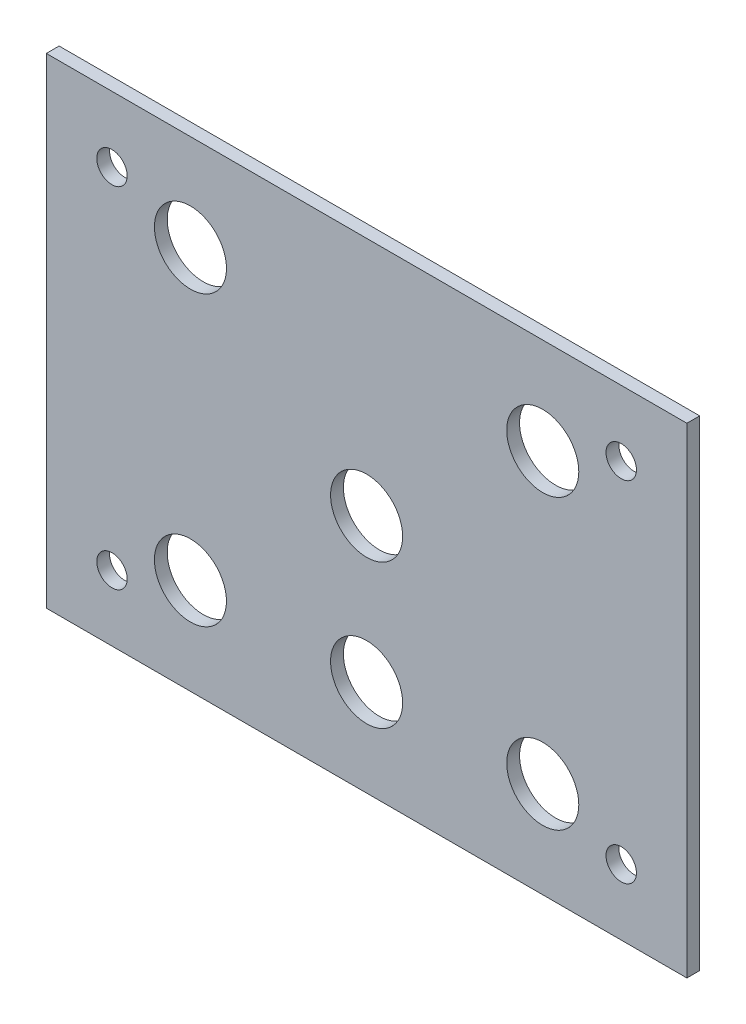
ISO-10303-21;
HEADER;
FILE_DESCRIPTION(('STEP AP214'),'2;1');
FILE_NAME('part.step','',(''),(''),'','','');
FILE_SCHEMA(('AUTOMOTIVE_DESIGN { 1 0 10303 214 1 1 1 1 }'));
ENDSEC;
DATA;
#1=APPLICATION_CONTEXT('core data for automotive mechanical design processes');
#2=APPLICATION_PROTOCOL_DEFINITION('international standard','automotive_design',2000,#1);
#3=PRODUCT_CONTEXT('',#1,'mechanical');
#4=PRODUCT('Part','Part','',(#3));
#5=PRODUCT_RELATED_PRODUCT_CATEGORY('part','',(#4));
#6=PRODUCT_DEFINITION_FORMATION('','',#4);
#7=PRODUCT_DEFINITION_CONTEXT('part definition',#1,'design');
#8=PRODUCT_DEFINITION('design','',#6,#7);
#9=PRODUCT_DEFINITION_SHAPE('','',#8);
#10=(LENGTH_UNIT() NAMED_UNIT(*) SI_UNIT(.MILLI.,.METRE.));
#11=(NAMED_UNIT(*) PLANE_ANGLE_UNIT() SI_UNIT($,.RADIAN.));
#12=(NAMED_UNIT(*) SI_UNIT($,.STERADIAN.) SOLID_ANGLE_UNIT());
#13=UNCERTAINTY_MEASURE_WITH_UNIT(LENGTH_MEASURE(1.E-05),#10,'distance_accuracy_value','');
#14=(GEOMETRIC_REPRESENTATION_CONTEXT(3) GLOBAL_UNCERTAINTY_ASSIGNED_CONTEXT((#13)) GLOBAL_UNIT_ASSIGNED_CONTEXT((#10,
#11,#12)) REPRESENTATION_CONTEXT('',''));
#15=CARTESIAN_POINT('',(0.,0.,0.));
#16=DIRECTION('',(0.,0.,1.));
#17=DIRECTION('',(1.,0.,0.));
#18=AXIS2_PLACEMENT_3D('',#15,#16,#17);
#19=CARTESIAN_POINT('',(0.,150.,4.));
#20=DIRECTION('',(0.,0.,-1.));
#21=DIRECTION('',(-1.,0.,0.));
#22=AXIS2_PLACEMENT_3D('',#19,#20,#21);
#23=PLANE('',#22);
#24=CARTESIAN_POINT('',(155.,30.,4.));
#25=DIRECTION('',(0.,0.,1.));
#26=DIRECTION('',(1.,0.,0.));
#27=AXIS2_PLACEMENT_3D('',#24,#25,#26);
#28=CIRCLE('',#27,11.25);
#29=CARTESIAN_POINT('',(166.25,30.,4.));
#30=VERTEX_POINT('',#29);
#31=EDGE_CURVE('E170',#30,#30,#28,.T.);
#32=ORIENTED_EDGE('',*,*,#31,.F.);
#33=EDGE_LOOP('',(#32));
#34=FACE_BOUND('',#33,.T.);
#35=CARTESIAN_POINT('',(100.,75.,4.));
#36=DIRECTION('',(0.,0.,1.));
#37=DIRECTION('',(1.,0.,0.));
#38=AXIS2_PLACEMENT_3D('',#35,#36,#37);
#39=CIRCLE('',#38,11.25);
#40=CARTESIAN_POINT('',(111.25,75.,4.));
#41=VERTEX_POINT('',#40);
#42=EDGE_CURVE('E164',#41,#41,#39,.T.);
#43=ORIENTED_EDGE('',*,*,#42,.F.);
#44=EDGE_LOOP('',(#43));
#45=FACE_BOUND('',#44,.T.);
#46=CARTESIAN_POINT('',(45.,30.,4.));
#47=DIRECTION('',(0.,0.,1.));
#48=DIRECTION('',(1.,0.,0.));
#49=AXIS2_PLACEMENT_3D('',#46,#47,#48);
#50=CIRCLE('',#49,11.25);
#51=CARTESIAN_POINT('',(56.25,30.,4.));
#52=VERTEX_POINT('',#51);
#53=EDGE_CURVE('E158',#52,#52,#50,.T.);
#54=ORIENTED_EDGE('',*,*,#53,.F.);
#55=EDGE_LOOP('',(#54));
#56=FACE_BOUND('',#55,.T.);
#57=CARTESIAN_POINT('',(100.,30.,4.));
#58=DIRECTION('',(0.,0.,1.));
#59=DIRECTION('',(1.,0.,0.));
#60=AXIS2_PLACEMENT_3D('',#57,#58,#59);
#61=CIRCLE('',#60,11.25);
#62=CARTESIAN_POINT('',(111.25,30.,4.));
#63=VERTEX_POINT('',#62);
#64=EDGE_CURVE('E152',#63,#63,#61,.T.);
#65=ORIENTED_EDGE('',*,*,#64,.F.);
#66=EDGE_LOOP('',(#65));
#67=FACE_BOUND('',#66,.T.);
#68=CARTESIAN_POINT('',(155.,120.,4.));
#69=DIRECTION('',(0.,0.,1.));
#70=DIRECTION('',(1.,0.,0.));
#71=AXIS2_PLACEMENT_3D('',#68,#69,#70);
#72=CIRCLE('',#71,11.25);
#73=CARTESIAN_POINT('',(166.25,120.,4.));
#74=VERTEX_POINT('',#73);
#75=EDGE_CURVE('E146',#74,#74,#72,.T.);
#76=ORIENTED_EDGE('',*,*,#75,.F.);
#77=EDGE_LOOP('',(#76));
#78=FACE_BOUND('',#77,.T.);
#79=CARTESIAN_POINT('',(45.,120.,4.));
#80=DIRECTION('',(0.,0.,1.));
#81=DIRECTION('',(1.,0.,0.));
#82=AXIS2_PLACEMENT_3D('',#79,#80,#81);
#83=CIRCLE('',#82,11.25);
#84=CARTESIAN_POINT('',(56.25,120.,4.));
#85=VERTEX_POINT('',#84);
#86=EDGE_CURVE('E140',#85,#85,#83,.T.);
#87=ORIENTED_EDGE('',*,*,#86,.F.);
#88=EDGE_LOOP('',(#87));
#89=FACE_BOUND('',#88,.T.);
#90=CARTESIAN_POINT('',(179.5,129.5,4.));
#91=DIRECTION('',(0.,0.,1.));
#92=DIRECTION('',(1.,0.,0.));
#93=AXIS2_PLACEMENT_3D('',#90,#91,#92);
#94=CIRCLE('',#93,4.75000000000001);
#95=CARTESIAN_POINT('',(184.25,129.5,4.));
#96=VERTEX_POINT('',#95);
#97=EDGE_CURVE('E125',#96,#96,#94,.T.);
#98=ORIENTED_EDGE('',*,*,#97,.F.);
#99=EDGE_LOOP('',(#98));
#100=FACE_BOUND('',#99,.T.);
#101=CARTESIAN_POINT('',(20.5,129.5,4.));
#102=DIRECTION('',(0.,0.,1.));
#103=DIRECTION('',(1.,0.,0.));
#104=AXIS2_PLACEMENT_3D('',#101,#102,#103);
#105=CIRCLE('',#104,4.75);
#106=CARTESIAN_POINT('',(25.25,129.5,4.));
#107=VERTEX_POINT('',#106);
#108=EDGE_CURVE('E104',#107,#107,#105,.T.);
#109=ORIENTED_EDGE('',*,*,#108,.F.);
#110=EDGE_LOOP('',(#109));
#111=FACE_BOUND('',#110,.T.);
#112=DIRECTION('',(0.,-1.,0.));
#113=VECTOR('',#112,1.);
#114=CARTESIAN_POINT('',(0.,0.,4.));
#115=LINE('',#114,#113);
#116=CARTESIAN_POINT('',(0.,150.,4.));
#117=VERTEX_POINT('',#116);
#118=CARTESIAN_POINT('',(0.,0.,4.));
#119=VERTEX_POINT('',#118);
#120=EDGE_CURVE('E89',#117,#119,#115,.T.);
#121=ORIENTED_EDGE('',*,*,#120,.T.);
#122=DIRECTION('',(1.,0.,0.));
#123=VECTOR('',#122,1.);
#124=CARTESIAN_POINT('',(0.,0.,4.));
#125=LINE('',#124,#123);
#126=CARTESIAN_POINT('',(200.,0.,4.));
#127=VERTEX_POINT('',#126);
#128=EDGE_CURVE('E84',#119,#127,#125,.T.);
#129=ORIENTED_EDGE('',*,*,#128,.T.);
#130=DIRECTION('',(0.,1.,0.));
#131=VECTOR('',#130,1.);
#132=CARTESIAN_POINT('',(200.,0.,4.));
#133=LINE('',#132,#131);
#134=CARTESIAN_POINT('',(200.,150.,4.));
#135=VERTEX_POINT('',#134);
#136=EDGE_CURVE('E87',#127,#135,#133,.T.);
#137=ORIENTED_EDGE('',*,*,#136,.T.);
#138=DIRECTION('',(-1.,0.,0.));
#139=VECTOR('',#138,1.);
#140=CARTESIAN_POINT('',(0.,150.,4.));
#141=LINE('',#140,#139);
#142=EDGE_CURVE('E54',#135,#117,#141,.T.);
#143=ORIENTED_EDGE('',*,*,#142,.T.);
#144=EDGE_LOOP('',(#121,#129,#137,#143));
#145=FACE_BOUND('',#144,.T.);
#146=CARTESIAN_POINT('',(179.5,20.5,4.));
#147=DIRECTION('',(0.,0.,1.));
#148=DIRECTION('',(1.,0.,0.));
#149=AXIS2_PLACEMENT_3D('',#146,#147,#148);
#150=CIRCLE('',#149,4.75);
#151=CARTESIAN_POINT('',(184.25,20.5,4.));
#152=VERTEX_POINT('',#151);
#153=EDGE_CURVE('E119',#152,#152,#150,.T.);
#154=ORIENTED_EDGE('',*,*,#153,.F.);
#155=EDGE_LOOP('',(#154));
#156=FACE_BOUND('',#155,.T.);
#157=CARTESIAN_POINT('',(20.5,20.5,4.));
#158=DIRECTION('',(0.,0.,1.));
#159=DIRECTION('',(1.,0.,0.));
#160=AXIS2_PLACEMENT_3D('',#157,#158,#159);
#161=CIRCLE('',#160,4.75);
#162=CARTESIAN_POINT('',(25.25,20.5,4.));
#163=VERTEX_POINT('',#162);
#164=EDGE_CURVE('E131',#163,#163,#161,.T.);
#165=ORIENTED_EDGE('',*,*,#164,.F.);
#166=EDGE_LOOP('',(#165));
#167=FACE_BOUND('',#166,.T.);
#168=ADVANCED_FACE('F37',(#34,#45,#56,#67,#78,#89,#100,#111,#145,#156,#167),#23,.F.);
#169=CARTESIAN_POINT('',(0.,150.,0.));
#170=DIRECTION('',(0.,0.,-1.));
#171=DIRECTION('',(-1.,0.,0.));
#172=AXIS2_PLACEMENT_3D('',#169,#170,#171);
#173=PLANE('',#172);
#174=CARTESIAN_POINT('',(155.,30.,0.));
#175=DIRECTION('',(0.,0.,1.));
#176=DIRECTION('',(1.,0.,0.));
#177=AXIS2_PLACEMENT_3D('',#174,#175,#176);
#178=CIRCLE('',#177,11.25);
#179=CARTESIAN_POINT('',(166.25,30.,0.));
#180=VERTEX_POINT('',#179);
#181=EDGE_CURVE('E167',#180,#180,#178,.T.);
#182=ORIENTED_EDGE('',*,*,#181,.T.);
#183=EDGE_LOOP('',(#182));
#184=FACE_BOUND('',#183,.T.);
#185=CARTESIAN_POINT('',(100.,75.,0.));
#186=DIRECTION('',(0.,0.,1.));
#187=DIRECTION('',(1.,0.,0.));
#188=AXIS2_PLACEMENT_3D('',#185,#186,#187);
#189=CIRCLE('',#188,11.25);
#190=CARTESIAN_POINT('',(111.25,75.,0.));
#191=VERTEX_POINT('',#190);
#192=EDGE_CURVE('E161',#191,#191,#189,.T.);
#193=ORIENTED_EDGE('',*,*,#192,.T.);
#194=EDGE_LOOP('',(#193));
#195=FACE_BOUND('',#194,.T.);
#196=CARTESIAN_POINT('',(45.,30.,0.));
#197=DIRECTION('',(0.,0.,1.));
#198=DIRECTION('',(1.,0.,0.));
#199=AXIS2_PLACEMENT_3D('',#196,#197,#198);
#200=CIRCLE('',#199,11.25);
#201=CARTESIAN_POINT('',(56.25,30.,0.));
#202=VERTEX_POINT('',#201);
#203=EDGE_CURVE('E155',#202,#202,#200,.T.);
#204=ORIENTED_EDGE('',*,*,#203,.T.);
#205=EDGE_LOOP('',(#204));
#206=FACE_BOUND('',#205,.T.);
#207=CARTESIAN_POINT('',(100.,30.,0.));
#208=DIRECTION('',(0.,0.,1.));
#209=DIRECTION('',(1.,0.,0.));
#210=AXIS2_PLACEMENT_3D('',#207,#208,#209);
#211=CIRCLE('',#210,11.25);
#212=CARTESIAN_POINT('',(111.25,30.,0.));
#213=VERTEX_POINT('',#212);
#214=EDGE_CURVE('E149',#213,#213,#211,.T.);
#215=ORIENTED_EDGE('',*,*,#214,.T.);
#216=EDGE_LOOP('',(#215));
#217=FACE_BOUND('',#216,.T.);
#218=CARTESIAN_POINT('',(155.,120.,0.));
#219=DIRECTION('',(0.,0.,1.));
#220=DIRECTION('',(1.,0.,0.));
#221=AXIS2_PLACEMENT_3D('',#218,#219,#220);
#222=CIRCLE('',#221,11.25);
#223=CARTESIAN_POINT('',(166.25,120.,0.));
#224=VERTEX_POINT('',#223);
#225=EDGE_CURVE('E143',#224,#224,#222,.T.);
#226=ORIENTED_EDGE('',*,*,#225,.T.);
#227=EDGE_LOOP('',(#226));
#228=FACE_BOUND('',#227,.T.);
#229=CARTESIAN_POINT('',(45.,120.,0.));
#230=DIRECTION('',(0.,0.,1.));
#231=DIRECTION('',(1.,0.,0.));
#232=AXIS2_PLACEMENT_3D('',#229,#230,#231);
#233=CIRCLE('',#232,11.25);
#234=CARTESIAN_POINT('',(56.25,120.,0.));
#235=VERTEX_POINT('',#234);
#236=EDGE_CURVE('E137',#235,#235,#233,.T.);
#237=ORIENTED_EDGE('',*,*,#236,.T.);
#238=EDGE_LOOP('',(#237));
#239=FACE_BOUND('',#238,.T.);
#240=CARTESIAN_POINT('',(179.5,129.5,0.));
#241=DIRECTION('',(0.,0.,1.));
#242=DIRECTION('',(1.,0.,0.));
#243=AXIS2_PLACEMENT_3D('',#240,#241,#242);
#244=CIRCLE('',#243,4.75000000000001);
#245=CARTESIAN_POINT('',(184.25,129.5,0.));
#246=VERTEX_POINT('',#245);
#247=EDGE_CURVE('E128',#246,#246,#244,.T.);
#248=ORIENTED_EDGE('',*,*,#247,.T.);
#249=EDGE_LOOP('',(#248));
#250=FACE_BOUND('',#249,.T.);
#251=CARTESIAN_POINT('',(20.5,129.5,0.));
#252=DIRECTION('',(0.,0.,1.));
#253=DIRECTION('',(1.,0.,0.));
#254=AXIS2_PLACEMENT_3D('',#251,#252,#253);
#255=CIRCLE('',#254,4.75);
#256=CARTESIAN_POINT('',(25.25,129.5,0.));
#257=VERTEX_POINT('',#256);
#258=EDGE_CURVE('E116',#257,#257,#255,.T.);
#259=ORIENTED_EDGE('',*,*,#258,.T.);
#260=EDGE_LOOP('',(#259));
#261=FACE_BOUND('',#260,.T.);
#262=DIRECTION('',(0.,-1.,0.));
#263=VECTOR('',#262,1.);
#264=CARTESIAN_POINT('',(0.,0.,0.));
#265=LINE('',#264,#263);
#266=CARTESIAN_POINT('',(0.,150.,0.));
#267=VERTEX_POINT('',#266);
#268=CARTESIAN_POINT('',(0.,0.,0.));
#269=VERTEX_POINT('',#268);
#270=EDGE_CURVE('E101',#267,#269,#265,.T.);
#271=ORIENTED_EDGE('',*,*,#270,.F.);
#272=DIRECTION('',(-1.,0.,0.));
#273=VECTOR('',#272,1.);
#274=CARTESIAN_POINT('',(0.,150.,0.));
#275=LINE('',#274,#273);
#276=CARTESIAN_POINT('',(200.,150.,0.));
#277=VERTEX_POINT('',#276);
#278=EDGE_CURVE('E77',#277,#267,#275,.T.);
#279=ORIENTED_EDGE('',*,*,#278,.F.);
#280=DIRECTION('',(0.,1.,0.));
#281=VECTOR('',#280,1.);
#282=CARTESIAN_POINT('',(200.,0.,0.));
#283=LINE('',#282,#281);
#284=CARTESIAN_POINT('',(200.,0.,0.));
#285=VERTEX_POINT('',#284);
#286=EDGE_CURVE('E71',#285,#277,#283,.T.);
#287=ORIENTED_EDGE('',*,*,#286,.F.);
#288=DIRECTION('',(1.,0.,0.));
#289=VECTOR('',#288,1.);
#290=CARTESIAN_POINT('',(0.,0.,0.));
#291=LINE('',#290,#289);
#292=EDGE_CURVE('E93',#269,#285,#291,.T.);
#293=ORIENTED_EDGE('',*,*,#292,.F.);
#294=EDGE_LOOP('',(#271,#279,#287,#293));
#295=FACE_BOUND('',#294,.T.);
#296=CARTESIAN_POINT('',(179.5,20.5,0.));
#297=DIRECTION('',(0.,0.,1.));
#298=DIRECTION('',(1.,0.,0.));
#299=AXIS2_PLACEMENT_3D('',#296,#297,#298);
#300=CIRCLE('',#299,4.75);
#301=CARTESIAN_POINT('',(184.25,20.5,0.));
#302=VERTEX_POINT('',#301);
#303=EDGE_CURVE('E122',#302,#302,#300,.T.);
#304=ORIENTED_EDGE('',*,*,#303,.T.);
#305=EDGE_LOOP('',(#304));
#306=FACE_BOUND('',#305,.T.);
#307=CARTESIAN_POINT('',(20.5,20.5,0.));
#308=DIRECTION('',(0.,0.,1.));
#309=DIRECTION('',(1.,0.,0.));
#310=AXIS2_PLACEMENT_3D('',#307,#308,#309);
#311=CIRCLE('',#310,4.75);
#312=CARTESIAN_POINT('',(25.25,20.5,0.));
#313=VERTEX_POINT('',#312);
#314=EDGE_CURVE('E134',#313,#313,#311,.T.);
#315=ORIENTED_EDGE('',*,*,#314,.T.);
#316=EDGE_LOOP('',(#315));
#317=FACE_BOUND('',#316,.T.);
#318=ADVANCED_FACE('F112',(#184,#195,#206,#217,#228,#239,#250,#261,#295,#306,#317),#173,.T.);
#319=CARTESIAN_POINT('',(0.,0.,4.));
#320=DIRECTION('',(1.,0.,0.));
#321=DIRECTION('',(0.,0.,-1.));
#322=AXIS2_PLACEMENT_3D('',#319,#320,#321);
#323=PLANE('',#322);
#324=ORIENTED_EDGE('',*,*,#270,.T.);
#325=DIRECTION('',(0.,0.,-1.));
#326=VECTOR('',#325,1.);
#327=CARTESIAN_POINT('',(0.,0.,4.));
#328=LINE('',#327,#326);
#329=EDGE_CURVE('E11',#119,#269,#328,.T.);
#330=ORIENTED_EDGE('',*,*,#329,.F.);
#331=ORIENTED_EDGE('',*,*,#120,.F.);
#332=DIRECTION('',(0.,0.,-1.));
#333=VECTOR('',#332,1.);
#334=CARTESIAN_POINT('',(0.,150.,4.));
#335=LINE('',#334,#333);
#336=EDGE_CURVE('E97',#117,#267,#335,.T.);
#337=ORIENTED_EDGE('',*,*,#336,.T.);
#338=EDGE_LOOP('',(#324,#330,#331,#337));
#339=FACE_BOUND('',#338,.T.);
#340=ADVANCED_FACE('F39',(#339),#323,.F.);
#341=CARTESIAN_POINT('',(0.,0.,4.));
#342=DIRECTION('',(0.,1.,0.));
#343=DIRECTION('',(0.,0.,1.));
#344=AXIS2_PLACEMENT_3D('',#341,#342,#343);
#345=PLANE('',#344);
#346=ORIENTED_EDGE('',*,*,#292,.T.);
#347=DIRECTION('',(0.,0.,-1.));
#348=VECTOR('',#347,1.);
#349=CARTESIAN_POINT('',(200.,0.,4.));
#350=LINE('',#349,#348);
#351=EDGE_CURVE('E46',#127,#285,#350,.T.);
#352=ORIENTED_EDGE('',*,*,#351,.F.);
#353=ORIENTED_EDGE('',*,*,#128,.F.);
#354=ORIENTED_EDGE('',*,*,#329,.T.);
#355=EDGE_LOOP('',(#346,#352,#353,#354));
#356=FACE_BOUND('',#355,.T.);
#357=ADVANCED_FACE('F92',(#356),#345,.F.);
#358=CARTESIAN_POINT('',(200.,0.,4.));
#359=DIRECTION('',(-1.,0.,0.));
#360=DIRECTION('',(0.,0.,1.));
#361=AXIS2_PLACEMENT_3D('',#358,#359,#360);
#362=PLANE('',#361);
#363=ORIENTED_EDGE('',*,*,#286,.T.);
#364=DIRECTION('',(0.,0.,-1.));
#365=VECTOR('',#364,1.);
#366=CARTESIAN_POINT('',(200.,150.,4.));
#367=LINE('',#366,#365);
#368=EDGE_CURVE('E94',#135,#277,#367,.T.);
#369=ORIENTED_EDGE('',*,*,#368,.F.);
#370=ORIENTED_EDGE('',*,*,#136,.F.);
#371=ORIENTED_EDGE('',*,*,#351,.T.);
#372=EDGE_LOOP('',(#363,#369,#370,#371));
#373=FACE_BOUND('',#372,.T.);
#374=ADVANCED_FACE('F95',(#373),#362,.F.);
#375=CARTESIAN_POINT('',(0.,150.,4.));
#376=DIRECTION('',(0.,-1.,0.));
#377=DIRECTION('',(1.,0.,0.));
#378=AXIS2_PLACEMENT_3D('',#375,#376,#377);
#379=PLANE('',#378);
#380=ORIENTED_EDGE('',*,*,#278,.T.);
#381=ORIENTED_EDGE('',*,*,#336,.F.);
#382=ORIENTED_EDGE('',*,*,#142,.F.);
#383=ORIENTED_EDGE('',*,*,#368,.T.);
#384=EDGE_LOOP('',(#380,#381,#382,#383));
#385=FACE_BOUND('',#384,.T.);
#386=ADVANCED_FACE('F109',(#385),#379,.F.);
#387=CARTESIAN_POINT('',(20.5,129.5,4.));
#388=DIRECTION('',(0.,0.,-1.));
#389=DIRECTION('',(-1.,0.,0.));
#390=AXIS2_PLACEMENT_3D('',#387,#388,#389);
#391=CYLINDRICAL_SURFACE('',#390,4.75);
#392=ORIENTED_EDGE('',*,*,#108,.T.);
#393=EDGE_LOOP('',(#392));
#394=FACE_BOUND('',#393,.T.);
#395=ORIENTED_EDGE('',*,*,#258,.F.);
#396=EDGE_LOOP('',(#395));
#397=FACE_BOUND('',#396,.T.);
#398=ADVANCED_FACE('F202',(#394,#397),#391,.F.);
#399=CARTESIAN_POINT('',(179.5,20.5,4.));
#400=DIRECTION('',(0.,0.,-1.));
#401=DIRECTION('',(-1.,0.,0.));
#402=AXIS2_PLACEMENT_3D('',#399,#400,#401);
#403=CYLINDRICAL_SURFACE('',#402,4.75);
#404=ORIENTED_EDGE('',*,*,#153,.T.);
#405=EDGE_LOOP('',(#404));
#406=FACE_BOUND('',#405,.T.);
#407=ORIENTED_EDGE('',*,*,#303,.F.);
#408=EDGE_LOOP('',(#407));
#409=FACE_BOUND('',#408,.T.);
#410=ADVANCED_FACE('F205',(#406,#409),#403,.F.);
#411=CARTESIAN_POINT('',(179.5,129.5,4.));
#412=DIRECTION('',(0.,0.,-1.));
#413=DIRECTION('',(-1.,0.,0.));
#414=AXIS2_PLACEMENT_3D('',#411,#412,#413);
#415=CYLINDRICAL_SURFACE('',#414,4.75000000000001);
#416=ORIENTED_EDGE('',*,*,#97,.T.);
#417=EDGE_LOOP('',(#416));
#418=FACE_BOUND('',#417,.T.);
#419=ORIENTED_EDGE('',*,*,#247,.F.);
#420=EDGE_LOOP('',(#419));
#421=FACE_BOUND('',#420,.T.);
#422=ADVANCED_FACE('F241',(#418,#421),#415,.F.);
#423=CARTESIAN_POINT('',(20.5,20.5,4.));
#424=DIRECTION('',(0.,0.,-1.));
#425=DIRECTION('',(-1.,0.,0.));
#426=AXIS2_PLACEMENT_3D('',#423,#424,#425);
#427=CYLINDRICAL_SURFACE('',#426,4.75);
#428=ORIENTED_EDGE('',*,*,#164,.T.);
#429=EDGE_LOOP('',(#428));
#430=FACE_BOUND('',#429,.T.);
#431=ORIENTED_EDGE('',*,*,#314,.F.);
#432=EDGE_LOOP('',(#431));
#433=FACE_BOUND('',#432,.T.);
#434=ADVANCED_FACE('F249',(#430,#433),#427,.F.);
#435=CARTESIAN_POINT('',(45.,120.,0.));
#436=DIRECTION('',(0.,0.,1.));
#437=DIRECTION('',(1.,0.,0.));
#438=AXIS2_PLACEMENT_3D('',#435,#436,#437);
#439=CYLINDRICAL_SURFACE('',#438,11.25);
#440=ORIENTED_EDGE('',*,*,#236,.F.);
#441=EDGE_LOOP('',(#440));
#442=FACE_BOUND('',#441,.T.);
#443=ORIENTED_EDGE('',*,*,#86,.T.);
#444=EDGE_LOOP('',(#443));
#445=FACE_BOUND('',#444,.T.);
#446=ADVANCED_FACE('F257',(#442,#445),#439,.F.);
#447=CARTESIAN_POINT('',(155.,120.,0.));
#448=DIRECTION('',(0.,0.,1.));
#449=DIRECTION('',(1.,0.,0.));
#450=AXIS2_PLACEMENT_3D('',#447,#448,#449);
#451=CYLINDRICAL_SURFACE('',#450,11.25);
#452=ORIENTED_EDGE('',*,*,#225,.F.);
#453=EDGE_LOOP('',(#452));
#454=FACE_BOUND('',#453,.T.);
#455=ORIENTED_EDGE('',*,*,#75,.T.);
#456=EDGE_LOOP('',(#455));
#457=FACE_BOUND('',#456,.T.);
#458=ADVANCED_FACE('F266',(#454,#457),#451,.F.);
#459=CARTESIAN_POINT('',(100.,30.,0.));
#460=DIRECTION('',(0.,0.,1.));
#461=DIRECTION('',(1.,0.,0.));
#462=AXIS2_PLACEMENT_3D('',#459,#460,#461);
#463=CYLINDRICAL_SURFACE('',#462,11.25);
#464=ORIENTED_EDGE('',*,*,#214,.F.);
#465=EDGE_LOOP('',(#464));
#466=FACE_BOUND('',#465,.T.);
#467=ORIENTED_EDGE('',*,*,#64,.T.);
#468=EDGE_LOOP('',(#467));
#469=FACE_BOUND('',#468,.T.);
#470=ADVANCED_FACE('F274',(#466,#469),#463,.F.);
#471=CARTESIAN_POINT('',(45.,30.,0.));
#472=DIRECTION('',(0.,0.,1.));
#473=DIRECTION('',(1.,0.,0.));
#474=AXIS2_PLACEMENT_3D('',#471,#472,#473);
#475=CYLINDRICAL_SURFACE('',#474,11.25);
#476=ORIENTED_EDGE('',*,*,#203,.F.);
#477=EDGE_LOOP('',(#476));
#478=FACE_BOUND('',#477,.T.);
#479=ORIENTED_EDGE('',*,*,#53,.T.);
#480=EDGE_LOOP('',(#479));
#481=FACE_BOUND('',#480,.T.);
#482=ADVANCED_FACE('F282',(#478,#481),#475,.F.);
#483=CARTESIAN_POINT('',(100.,75.,0.));
#484=DIRECTION('',(0.,0.,1.));
#485=DIRECTION('',(1.,0.,0.));
#486=AXIS2_PLACEMENT_3D('',#483,#484,#485);
#487=CYLINDRICAL_SURFACE('',#486,11.25);
#488=ORIENTED_EDGE('',*,*,#192,.F.);
#489=EDGE_LOOP('',(#488));
#490=FACE_BOUND('',#489,.T.);
#491=ORIENTED_EDGE('',*,*,#42,.T.);
#492=EDGE_LOOP('',(#491));
#493=FACE_BOUND('',#492,.T.);
#494=ADVANCED_FACE('F181',(#490,#493),#487,.F.);
#495=CARTESIAN_POINT('',(155.,30.,0.));
#496=DIRECTION('',(0.,0.,1.));
#497=DIRECTION('',(1.,0.,0.));
#498=AXIS2_PLACEMENT_3D('',#495,#496,#497);
#499=CYLINDRICAL_SURFACE('',#498,11.25);
#500=ORIENTED_EDGE('',*,*,#181,.F.);
#501=EDGE_LOOP('',(#500));
#502=FACE_BOUND('',#501,.T.);
#503=ORIENTED_EDGE('',*,*,#31,.T.);
#504=EDGE_LOOP('',(#503));
#505=FACE_BOUND('',#504,.T.);
#506=ADVANCED_FACE('F178',(#502,#505),#499,.F.);
#507=CLOSED_SHELL('',(#168,#318,#340,#357,#374,#386,#398,#410,#422,#434,#446,#458,#470,#482,
#494,#506));
#508=MANIFOLD_SOLID_BREP('B2',#507);
#509=ADVANCED_BREP_SHAPE_REPRESENTATION('',(#18,#508),#14);
#510=SHAPE_DEFINITION_REPRESENTATION(#9,#509);
ENDSEC;
END-ISO-10303-21;
